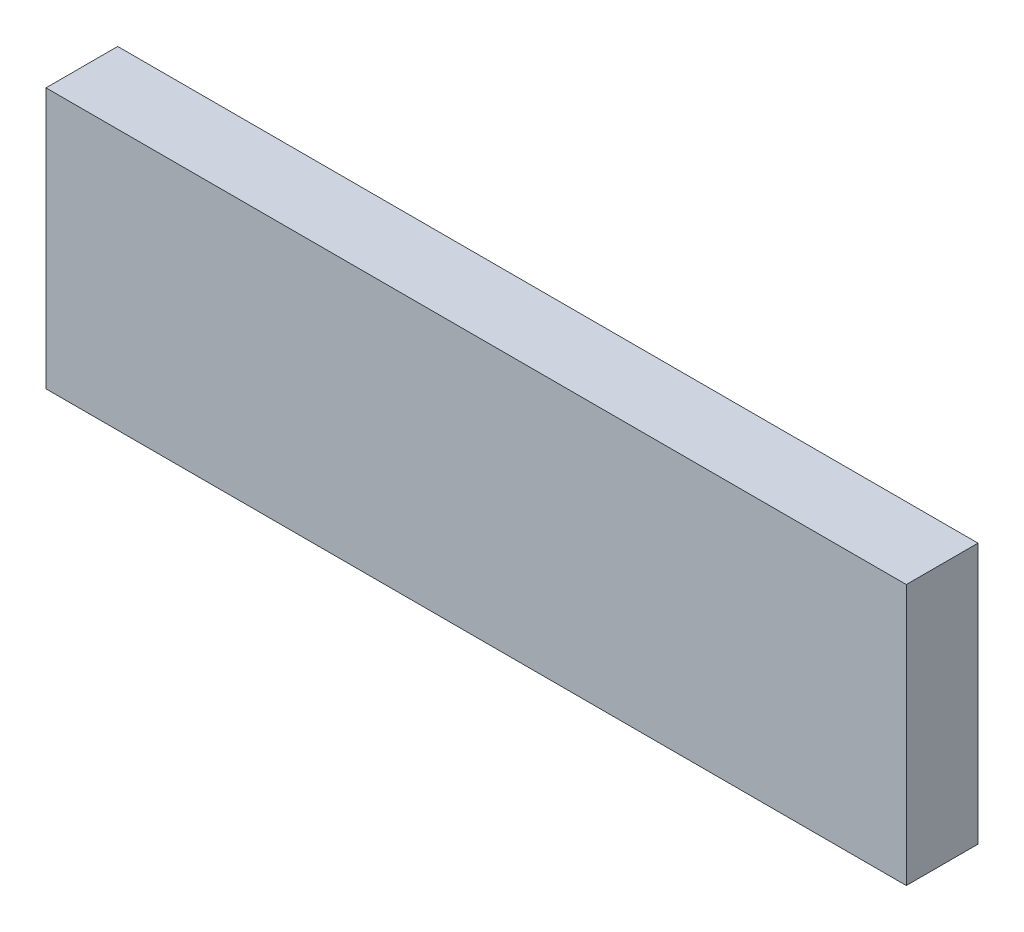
ISO-10303-21;
HEADER;
FILE_DESCRIPTION(('STEP AP214'),'2;1');
FILE_NAME('part.step','',(''),(''),'','','');
FILE_SCHEMA(('AUTOMOTIVE_DESIGN { 1 0 10303 214 1 1 1 1 }'));
ENDSEC;
DATA;
#1=APPLICATION_CONTEXT('core data for automotive mechanical design processes');
#2=APPLICATION_PROTOCOL_DEFINITION('international standard','automotive_design',2000,#1);
#3=PRODUCT_CONTEXT('',#1,'mechanical');
#4=PRODUCT('Part','Part','',(#3));
#5=PRODUCT_RELATED_PRODUCT_CATEGORY('part','',(#4));
#6=PRODUCT_DEFINITION_FORMATION('','',#4);
#7=PRODUCT_DEFINITION_CONTEXT('part definition',#1,'design');
#8=PRODUCT_DEFINITION('design','',#6,#7);
#9=PRODUCT_DEFINITION_SHAPE('','',#8);
#10=(LENGTH_UNIT() NAMED_UNIT(*) SI_UNIT(.MILLI.,.METRE.));
#11=(NAMED_UNIT(*) PLANE_ANGLE_UNIT() SI_UNIT($,.RADIAN.));
#12=(NAMED_UNIT(*) SI_UNIT($,.STERADIAN.) SOLID_ANGLE_UNIT());
#13=UNCERTAINTY_MEASURE_WITH_UNIT(LENGTH_MEASURE(1.E-05),#10,'distance_accuracy_value','');
#14=(GEOMETRIC_REPRESENTATION_CONTEXT(3) GLOBAL_UNCERTAINTY_ASSIGNED_CONTEXT((#13)) GLOBAL_UNIT_ASSIGNED_CONTEXT((#10,
#11,#12)) REPRESENTATION_CONTEXT('',''));
#15=CARTESIAN_POINT('',(0.,0.,0.));
#16=DIRECTION('',(0.,0.,1.));
#17=DIRECTION('',(1.,0.,0.));
#18=AXIS2_PLACEMENT_3D('',#15,#16,#17);
#19=CARTESIAN_POINT('',(0.,0.,5.5));
#20=DIRECTION('',(1.,0.,0.));
#21=DIRECTION('',(0.,0.,-1.));
#22=AXIS2_PLACEMENT_3D('',#19,#20,#21);
#23=PLANE('',#22);
#24=DIRECTION('',(0.,-1.,0.));
#25=VECTOR('',#24,1.);
#26=CARTESIAN_POINT('',(0.,0.,0.));
#27=LINE('',#26,#25);
#28=CARTESIAN_POINT('',(0.,20.,0.));
#29=VERTEX_POINT('',#28);
#30=CARTESIAN_POINT('',(0.,0.,0.));
#31=VERTEX_POINT('',#30);
#32=EDGE_CURVE('E104',#29,#31,#27,.T.);
#33=ORIENTED_EDGE('',*,*,#32,.T.);
#34=DIRECTION('',(0.,0.,-1.));
#35=VECTOR('',#34,1.);
#36=CARTESIAN_POINT('',(0.,0.,5.5));
#37=LINE('',#36,#35);
#38=CARTESIAN_POINT('',(0.,0.,5.5));
#39=VERTEX_POINT('',#38);
#40=EDGE_CURVE('E11',#39,#31,#37,.T.);
#41=ORIENTED_EDGE('',*,*,#40,.F.);
#42=DIRECTION('',(0.,-1.,0.));
#43=VECTOR('',#42,1.);
#44=CARTESIAN_POINT('',(0.,0.,5.5));
#45=LINE('',#44,#43);
#46=CARTESIAN_POINT('',(0.,20.,5.5));
#47=VERTEX_POINT('',#46);
#48=EDGE_CURVE('E92',#47,#39,#45,.T.);
#49=ORIENTED_EDGE('',*,*,#48,.F.);
#50=DIRECTION('',(0.,0.,-1.));
#51=VECTOR('',#50,1.);
#52=CARTESIAN_POINT('',(0.,20.,5.5));
#53=LINE('',#52,#51);
#54=EDGE_CURVE('E100',#47,#29,#53,.T.);
#55=ORIENTED_EDGE('',*,*,#54,.T.);
#56=EDGE_LOOP('',(#33,#41,#49,#55));
#57=FACE_BOUND('',#56,.T.);
#58=ADVANCED_FACE('F41',(#57),#23,.F.);
#59=CARTESIAN_POINT('',(0.,0.,5.5));
#60=DIRECTION('',(0.,1.,0.));
#61=DIRECTION('',(0.,0.,1.));
#62=AXIS2_PLACEMENT_3D('',#59,#60,#61);
#63=PLANE('',#62);
#64=DIRECTION('',(1.,0.,0.));
#65=VECTOR('',#64,1.);
#66=CARTESIAN_POINT('',(0.,0.,0.));
#67=LINE('',#66,#65);
#68=CARTESIAN_POINT('',(66.,0.,0.));
#69=VERTEX_POINT('',#68);
#70=EDGE_CURVE('E96',#31,#69,#67,.T.);
#71=ORIENTED_EDGE('',*,*,#70,.T.);
#72=DIRECTION('',(0.,0.,-1.));
#73=VECTOR('',#72,1.);
#74=CARTESIAN_POINT('',(66.,0.,5.5));
#75=LINE('',#74,#73);
#76=CARTESIAN_POINT('',(66.,0.,5.5));
#77=VERTEX_POINT('',#76);
#78=EDGE_CURVE('E49',#77,#69,#75,.T.);
#79=ORIENTED_EDGE('',*,*,#78,.F.);
#80=DIRECTION('',(1.,0.,0.));
#81=VECTOR('',#80,1.);
#82=CARTESIAN_POINT('',(0.,0.,5.5));
#83=LINE('',#82,#81);
#84=EDGE_CURVE('E87',#39,#77,#83,.T.);
#85=ORIENTED_EDGE('',*,*,#84,.F.);
#86=ORIENTED_EDGE('',*,*,#40,.T.);
#87=EDGE_LOOP('',(#71,#79,#85,#86));
#88=FACE_BOUND('',#87,.T.);
#89=ADVANCED_FACE('F95',(#88),#63,.F.);
#90=CARTESIAN_POINT('',(66.,0.,5.5));
#91=DIRECTION('',(-1.,0.,0.));
#92=DIRECTION('',(0.,0.,1.));
#93=AXIS2_PLACEMENT_3D('',#90,#91,#92);
#94=PLANE('',#93);
#95=DIRECTION('',(0.,1.,0.));
#96=VECTOR('',#95,1.);
#97=CARTESIAN_POINT('',(66.,0.,0.));
#98=LINE('',#97,#96);
#99=CARTESIAN_POINT('',(66.,20.,0.));
#100=VERTEX_POINT('',#99);
#101=EDGE_CURVE('E74',#69,#100,#98,.T.);
#102=ORIENTED_EDGE('',*,*,#101,.T.);
#103=DIRECTION('',(0.,0.,-1.));
#104=VECTOR('',#103,1.);
#105=CARTESIAN_POINT('',(66.,20.,5.5));
#106=LINE('',#105,#104);
#107=CARTESIAN_POINT('',(66.,20.,5.5));
#108=VERTEX_POINT('',#107);
#109=EDGE_CURVE('E97',#108,#100,#106,.T.);
#110=ORIENTED_EDGE('',*,*,#109,.F.);
#111=DIRECTION('',(0.,1.,0.));
#112=VECTOR('',#111,1.);
#113=CARTESIAN_POINT('',(66.,0.,5.5));
#114=LINE('',#113,#112);
#115=EDGE_CURVE('E90',#77,#108,#114,.T.);
#116=ORIENTED_EDGE('',*,*,#115,.F.);
#117=ORIENTED_EDGE('',*,*,#78,.T.);
#118=EDGE_LOOP('',(#102,#110,#116,#117));
#119=FACE_BOUND('',#118,.T.);
#120=ADVANCED_FACE('F98',(#119),#94,.F.);
#121=CARTESIAN_POINT('',(0.,20.,5.5));
#122=DIRECTION('',(0.,-1.,0.));
#123=DIRECTION('',(0.,0.,-1.));
#124=AXIS2_PLACEMENT_3D('',#121,#122,#123);
#125=PLANE('',#124);
#126=DIRECTION('',(-1.,0.,0.));
#127=VECTOR('',#126,1.);
#128=CARTESIAN_POINT('',(0.,20.,0.));
#129=LINE('',#128,#127);
#130=EDGE_CURVE('E80',#100,#29,#129,.T.);
#131=ORIENTED_EDGE('',*,*,#130,.T.);
#132=ORIENTED_EDGE('',*,*,#54,.F.);
#133=DIRECTION('',(-1.,0.,0.));
#134=VECTOR('',#133,1.);
#135=CARTESIAN_POINT('',(0.,20.,5.5));
#136=LINE('',#135,#134);
#137=EDGE_CURVE('E57',#108,#47,#136,.T.);
#138=ORIENTED_EDGE('',*,*,#137,.F.);
#139=ORIENTED_EDGE('',*,*,#109,.T.);
#140=EDGE_LOOP('',(#131,#132,#138,#139));
#141=FACE_BOUND('',#140,.T.);
#142=ADVANCED_FACE('F111',(#141),#125,.F.);
#143=CARTESIAN_POINT('',(0.,0.,5.5));
#144=DIRECTION('',(0.,0.,-1.));
#145=DIRECTION('',(-1.,0.,0.));
#146=AXIS2_PLACEMENT_3D('',#143,#144,#145);
#147=PLANE('',#146);
#148=ORIENTED_EDGE('',*,*,#48,.T.);
#149=ORIENTED_EDGE('',*,*,#84,.T.);
#150=ORIENTED_EDGE('',*,*,#115,.T.);
#151=ORIENTED_EDGE('',*,*,#137,.T.);
#152=EDGE_LOOP('',(#148,#149,#150,#151));
#153=FACE_BOUND('',#152,.T.);
#154=ADVANCED_FACE('F88',(#153),#147,.F.);
#155=CARTESIAN_POINT('',(0.,0.,0.));
#156=DIRECTION('',(0.,0.,-1.));
#157=DIRECTION('',(-1.,0.,0.));
#158=AXIS2_PLACEMENT_3D('',#155,#156,#157);
#159=PLANE('',#158);
#160=ORIENTED_EDGE('',*,*,#32,.F.);
#161=ORIENTED_EDGE('',*,*,#130,.F.);
#162=ORIENTED_EDGE('',*,*,#101,.F.);
#163=ORIENTED_EDGE('',*,*,#70,.F.);
#164=EDGE_LOOP('',(#160,#161,#162,#163));
#165=FACE_BOUND('',#164,.T.);
#166=ADVANCED_FACE('F114',(#165),#159,.T.);
#167=CLOSED_SHELL('',(#58,#89,#120,#142,#154,#166));
#168=MANIFOLD_SOLID_BREP('B2',#167);
#169=ADVANCED_BREP_SHAPE_REPRESENTATION('',(#18,#168),#14);
#170=SHAPE_DEFINITION_REPRESENTATION(#9,#169);
ENDSEC;
END-ISO-10303-21;
